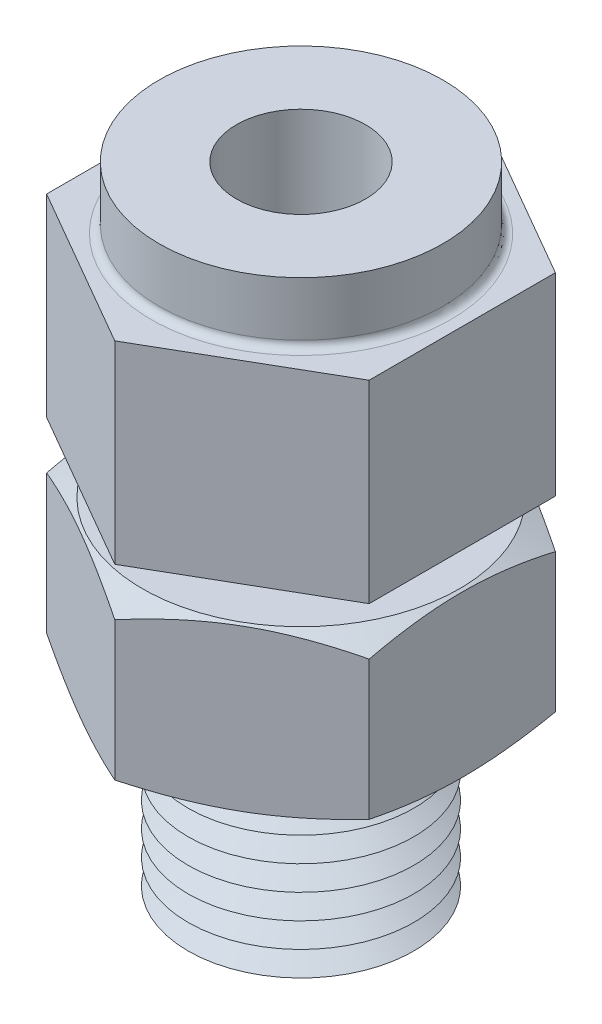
from build123d import *

# Parameters (mm, degrees)
SKETCH3_W           = 20.163939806
SKETCH3_H           = 20.163939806
CUT_EXTRUDE1_DEPTH  = 8.026393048
SKETCH4_R           = 5.55625
BOSS_EXTRUDE1_DEPTH = 1.7272
BOSS_EXTRUDE3_DEPTH = 9.525
SKETCH9_R           = 6.985
BOSS_EXTRUDE4_DEPTH = 3.048
SKETCH10_R          = 3.175
CUT_EXTRUDE2_DEPTH  = 34.725466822
FILLET1_R           = 0.381


with BuildPart() as part:
    # Sketch1 → Base-Revolve (revolve)
    with BuildSketch(Plane.XY, mode=Mode.PRIVATE) as base_revolve_sk:
        Polygon((0, 0), (7.801056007, 0), (9.165427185, 0.558104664), (9.165427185, 7.390176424), (7.801056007, 8.026393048), (0, 8.026393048), align=None)
    revolve(base_revolve_sk.sketch.rotate(Axis((0, 0, 0), (0, 1, 0)), 90), axis=Axis((0, 0, 0), (0, 1, 0)))

    # Sketch2 → Boss-Revolve1 (revolve)
    with BuildSketch(Plane.XY, mode=Mode.PRIVATE) as boss_revolve1_sk:
        Polygon((0, -9.144), (4.502114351, -9.144), (5.556245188, -8.535397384), (4.502114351, -7.926794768), (5.556245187, -7.318192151), (4.502114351, -6.709589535), (5.556245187, -6.100986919), (4.502114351, -5.492384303), (5.556245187, -4.883781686), (4.502114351, -4.27517907), (5.556245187, -3.666576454), (4.502114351, -3.057973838), (5.556245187, -2.449371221), (4.502114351, -1.840768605), (5.556506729, -1.214432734), (4.468496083, -0.586269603), (5.556245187, -0.014960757), (5.556245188, 0), (0, 0), align=None)
    revolve(boss_revolve1_sk.sketch.rotate(Axis((0, 0, 0), (0, 1, 0)), 90), axis=Axis((0, 0, 0), (0, 1, 0)))

    # Sketch3 → Cut-Extrude1 (cut)
    with BuildSketch(Plane(origin=(0, 8.026393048, 0), x_dir=(-1, 0, 0), z_dir=(0, 1, 0))):
        Rectangle(SKETCH3_W, SKETCH3_H)
        Polygon((7.937493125, 4.582712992), (2.079e-06, 9.165427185), (-7.937491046, 4.582716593), (-7.937495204, -4.582709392), (-6.236e-06, -9.165427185), (7.937488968, -4.582720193), align=None, mode=Mode.SUBTRACT)
    extrude(amount=-CUT_EXTRUDE1_DEPTH, mode=Mode.SUBTRACT)

    # Sketch4 → Boss-Extrude1 (add)
    with BuildSketch(Plane(origin=(0, 8.026393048, 0), x_dir=(-1, 0, 0), z_dir=(0, 1, 0))):
        with Locations(Location((0, 0, 0), (0, 0, 270))):
            Circle(SKETCH4_R)
    extrude(amount=BOSS_EXTRUDE1_DEPTH)

    # Sketch8 → Boss-Extrude3 (add)
    with BuildSketch(Plane(origin=(0, 9.753593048, 0), x_dir=(-1, 0, 0), z_dir=(0, 1, 0))):
        Polygon((-7.937495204, -4.582709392), (-7.937491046, 4.582716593), (2.079e-06, 9.165427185), (7.937493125, 4.582712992), (7.937488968, -4.582720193), (-6.236e-06, -9.165427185), align=None)
    extrude(amount=BOSS_EXTRUDE3_DEPTH)

    # Sketch9 → Boss-Extrude4 (add)
    with BuildSketch(Plane(origin=(0, 19.278593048, 0), x_dir=(-1, 0, 0), z_dir=(0, 1, 0))):
        with Locations(Location((0, 0, 0), (0, 0, 270))):
            Circle(SKETCH9_R)
    extrude(amount=BOSS_EXTRUDE4_DEPTH)

    # Sketch10 → Cut-Extrude2 (cut, through all)
    with BuildSketch(Plane(origin=(0, 22.326593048, 0), x_dir=(-1, 0, 0), z_dir=(0, 1, 0))):
        with Locations(Location((0, 0, 0), (0, 0, 90))):
            Circle(SKETCH10_R)
    extrude(amount=-CUT_EXTRUDE2_DEPTH, mode=Mode.SUBTRACT)

    # Fillet1
    fillet1_edges = [part.edges().sort_by_distance(p)[0] for p in [
        (0, 19.278593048, 6.985),
    ]]
    fillet(fillet1_edges, radius=FILLET1_R)


solid = part.part
